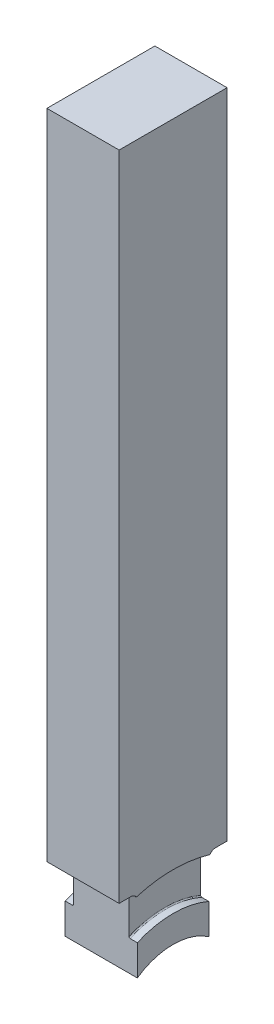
ISO-10303-21;
HEADER;
FILE_DESCRIPTION(('STEP AP214'),'2;1');
FILE_NAME('part.step','',(''),(''),'','','');
FILE_SCHEMA(('AUTOMOTIVE_DESIGN { 1 0 10303 214 1 1 1 1 }'));
ENDSEC;
DATA;
#1=APPLICATION_CONTEXT('core data for automotive mechanical design processes');
#2=APPLICATION_PROTOCOL_DEFINITION('international standard','automotive_design',2000,#1);
#3=PRODUCT_CONTEXT('',#1,'mechanical');
#4=PRODUCT('Part','Part','',(#3));
#5=PRODUCT_RELATED_PRODUCT_CATEGORY('part','',(#4));
#6=PRODUCT_DEFINITION_FORMATION('','',#4);
#7=PRODUCT_DEFINITION_CONTEXT('part definition',#1,'design');
#8=PRODUCT_DEFINITION('design','',#6,#7);
#9=PRODUCT_DEFINITION_SHAPE('','',#8);
#10=(LENGTH_UNIT() NAMED_UNIT(*) SI_UNIT(.MILLI.,.METRE.));
#11=(NAMED_UNIT(*) PLANE_ANGLE_UNIT() SI_UNIT($,.RADIAN.));
#12=(NAMED_UNIT(*) SI_UNIT($,.STERADIAN.) SOLID_ANGLE_UNIT());
#13=UNCERTAINTY_MEASURE_WITH_UNIT(LENGTH_MEASURE(1.E-05),#10,'distance_accuracy_value','');
#14=(GEOMETRIC_REPRESENTATION_CONTEXT(3) GLOBAL_UNCERTAINTY_ASSIGNED_CONTEXT((#13)) GLOBAL_UNIT_ASSIGNED_CONTEXT((#10,
#11,#12)) REPRESENTATION_CONTEXT('',''));
#15=CARTESIAN_POINT('',(0.,0.,0.));
#16=DIRECTION('',(0.,0.,1.));
#17=DIRECTION('',(1.,0.,0.));
#18=AXIS2_PLACEMENT_3D('',#15,#16,#17);
#19=CARTESIAN_POINT('',(12.827,276.225,19.177));
#20=DIRECTION('',(0.,0.,-1.));
#21=DIRECTION('',(0.,1.,0.));
#22=AXIS2_PLACEMENT_3D('',#19,#20,#21);
#23=PLANE('',#22);
#24=DIRECTION('',(0.,-1.,0.));
#25=VECTOR('',#24,1.);
#26=CARTESIAN_POINT('',(-12.827,276.225,19.177));
#27=LINE('',#26,#25);
#28=CARTESIAN_POINT('',(-12.827,276.225,19.177));
#29=VERTEX_POINT('',#28);
#30=CARTESIAN_POINT('',(-12.8270000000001,44.4246,19.177));
#31=VERTEX_POINT('',#30);
#32=EDGE_CURVE('E317',#29,#31,#27,.T.);
#33=ORIENTED_EDGE('',*,*,#32,.T.);
#34=DIRECTION('',(1.,0.,0.));
#35=VECTOR('',#34,1.);
#36=CARTESIAN_POINT('',(12.827,44.4246,19.177));
#37=LINE('',#36,#35);
#38=CARTESIAN_POINT('',(12.8270000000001,44.4246,19.177));
#39=VERTEX_POINT('',#38);
#40=EDGE_CURVE('E284',#31,#39,#37,.T.);
#41=ORIENTED_EDGE('',*,*,#40,.T.);
#42=DIRECTION('',(0.,-1.,0.));
#43=VECTOR('',#42,1.);
#44=CARTESIAN_POINT('',(12.827,276.225,19.177));
#45=LINE('',#44,#43);
#46=CARTESIAN_POINT('',(12.827,276.225,19.177));
#47=VERTEX_POINT('',#46);
#48=EDGE_CURVE('E308',#47,#39,#45,.T.);
#49=ORIENTED_EDGE('',*,*,#48,.F.);
#50=DIRECTION('',(-1.,0.,0.));
#51=VECTOR('',#50,1.);
#52=CARTESIAN_POINT('',(12.827,276.225,19.177));
#53=LINE('',#52,#51);
#54=EDGE_CURVE('E323',#47,#29,#53,.T.);
#55=ORIENTED_EDGE('',*,*,#54,.T.);
#56=EDGE_LOOP('',(#33,#41,#49,#55));
#57=FACE_BOUND('',#56,.T.);
#58=ADVANCED_FACE('F37',(#57),#23,.F.);
#59=CARTESIAN_POINT('',(12.827,276.225,-19.177));
#60=DIRECTION('',(0.,0.,1.));
#61=DIRECTION('',(0.,-1.,0.));
#62=AXIS2_PLACEMENT_3D('',#59,#60,#61);
#63=PLANE('',#62);
#64=DIRECTION('',(0.,1.,0.));
#65=VECTOR('',#64,1.);
#66=CARTESIAN_POINT('',(12.827,276.225,-19.177));
#67=LINE('',#66,#65);
#68=CARTESIAN_POINT('',(12.8270000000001,44.4246,-19.177));
#69=VERTEX_POINT('',#68);
#70=CARTESIAN_POINT('',(12.827,276.225,-19.177));
#71=VERTEX_POINT('',#70);
#72=EDGE_CURVE('E312',#69,#71,#67,.T.);
#73=ORIENTED_EDGE('',*,*,#72,.F.);
#74=DIRECTION('',(-1.,0.,0.));
#75=VECTOR('',#74,1.);
#76=CARTESIAN_POINT('',(12.827,44.4246,-19.177));
#77=LINE('',#76,#75);
#78=CARTESIAN_POINT('',(-12.8270000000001,44.4246,-19.177));
#79=VERTEX_POINT('',#78);
#80=EDGE_CURVE('E196',#69,#79,#77,.T.);
#81=ORIENTED_EDGE('',*,*,#80,.T.);
#82=DIRECTION('',(0.,1.,0.));
#83=VECTOR('',#82,1.);
#84=CARTESIAN_POINT('',(-12.827,276.225,-19.177));
#85=LINE('',#84,#83);
#86=CARTESIAN_POINT('',(-12.827,276.225,-19.177));
#87=VERTEX_POINT('',#86);
#88=EDGE_CURVE('E309',#79,#87,#85,.T.);
#89=ORIENTED_EDGE('',*,*,#88,.T.);
#90=DIRECTION('',(-1.,0.,0.));
#91=VECTOR('',#90,1.);
#92=CARTESIAN_POINT('',(12.827,276.225,-19.177));
#93=LINE('',#92,#91);
#94=EDGE_CURVE('E314',#71,#87,#93,.T.);
#95=ORIENTED_EDGE('',*,*,#94,.F.);
#96=EDGE_LOOP('',(#73,#81,#89,#95));
#97=FACE_BOUND('',#96,.T.);
#98=ADVANCED_FACE('F435',(#97),#63,.F.);
#99=CARTESIAN_POINT('',(12.827,0.,0.));
#100=DIRECTION('',(-1.,0.,0.));
#101=DIRECTION('',(0.,0.,1.));
#102=AXIS2_PLACEMENT_3D('',#99,#100,#101);
#103=PLANE('',#102);
#104=CARTESIAN_POINT('',(12.827,0.,0.));
#105=DIRECTION('',(1.,0.,0.));
#106=DIRECTION('',(0.,0.,-1.));
#107=AXIS2_PLACEMENT_3D('',#104,#105,#106);
#108=CIRCLE('',#107,22.225);
#109=CARTESIAN_POINT('',(12.8270000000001,18.2389864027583,-12.7));
#110=VERTEX_POINT('',#109);
#111=CARTESIAN_POINT('',(12.8270000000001,18.2389864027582,12.7));
#112=VERTEX_POINT('',#111);
#113=EDGE_CURVE('E294',#110,#112,#108,.T.);
#114=ORIENTED_EDGE('',*,*,#113,.F.);
#115=DIRECTION('',(0.,-1.,0.));
#116=VECTOR('',#115,1.);
#117=CARTESIAN_POINT('',(12.8270000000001,0.,-12.7));
#118=LINE('',#117,#116);
#119=CARTESIAN_POINT('',(12.8270000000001,29.0993556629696,-12.7));
#120=VERTEX_POINT('',#119);
#121=EDGE_CURVE('E201',#120,#110,#118,.T.);
#122=ORIENTED_EDGE('',*,*,#121,.F.);
#123=CARTESIAN_POINT('',(12.8270000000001,0.,0.));
#124=DIRECTION('',(-1.,0.,0.));
#125=DIRECTION('',(0.,0.,1.));
#126=AXIS2_PLACEMENT_3D('',#123,#124,#125);
#127=CIRCLE('',#126,31.75);
#128=CARTESIAN_POINT('',(12.8270000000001,29.0993556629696,12.7));
#129=VERTEX_POINT('',#128);
#130=EDGE_CURVE('E290',#129,#120,#127,.T.);
#131=ORIENTED_EDGE('',*,*,#130,.F.);
#132=DIRECTION('',(0.,1.,0.));
#133=VECTOR('',#132,1.);
#134=CARTESIAN_POINT('',(12.8270000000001,0.,12.7));
#135=LINE('',#134,#133);
#136=EDGE_CURVE('E234',#112,#129,#135,.T.);
#137=ORIENTED_EDGE('',*,*,#136,.F.);
#138=EDGE_LOOP('',(#114,#122,#131,#137));
#139=FACE_BOUND('',#138,.T.);
#140=ADVANCED_FACE('F429',(#139),#103,.F.);
#141=CARTESIAN_POINT('',(-12.827,0.,0.));
#142=DIRECTION('',(-1.,0.,0.));
#143=DIRECTION('',(0.,0.,1.));
#144=AXIS2_PLACEMENT_3D('',#141,#142,#143);
#145=PLANE('',#144);
#146=CARTESIAN_POINT('',(-12.8270000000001,42.037,-15.0876));
#147=DIRECTION('',(1.,0.,0.));
#148=DIRECTION('',(0.,0.,1.));
#149=AXIS2_PLACEMENT_3D('',#146,#147,#148);
#150=CIRCLE('',#149,2.3876);
#151=CARTESIAN_POINT('',(-12.8270000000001,44.4246,-15.0876));
#152=VERTEX_POINT('',#151);
#153=CARTESIAN_POINT('',(-12.8270000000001,43.3090510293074,-13.0670753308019));
#154=VERTEX_POINT('',#153);
#155=EDGE_CURVE('E209',#152,#154,#150,.T.);
#156=ORIENTED_EDGE('',*,*,#155,.T.);
#157=CARTESIAN_POINT('',(-12.8270000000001,0.,0.));
#158=DIRECTION('',(-1.,0.,0.));
#159=DIRECTION('',(0.,0.,1.));
#160=AXIS2_PLACEMENT_3D('',#157,#158,#159);
#161=CIRCLE('',#160,45.2374);
#162=CARTESIAN_POINT('',(-12.8270000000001,43.3090510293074,13.0670753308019));
#163=VERTEX_POINT('',#162);
#164=EDGE_CURVE('E291',#163,#154,#161,.T.);
#165=ORIENTED_EDGE('',*,*,#164,.F.);
#166=CARTESIAN_POINT('',(-12.8270000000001,42.037,15.0876));
#167=DIRECTION('',(1.,0.,0.));
#168=DIRECTION('',(0.,0.,-1.));
#169=AXIS2_PLACEMENT_3D('',#166,#167,#168);
#170=CIRCLE('',#169,2.3876);
#171=CARTESIAN_POINT('',(-12.8270000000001,44.4246,15.0876));
#172=VERTEX_POINT('',#171);
#173=EDGE_CURVE('E236',#163,#172,#170,.T.);
#174=ORIENTED_EDGE('',*,*,#173,.T.);
#175=DIRECTION('',(0.,0.,1.));
#176=VECTOR('',#175,1.);
#177=CARTESIAN_POINT('',(-12.8270000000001,44.4246,15.0876));
#178=LINE('',#177,#176);
#179=EDGE_CURVE('E239',#172,#31,#178,.T.);
#180=ORIENTED_EDGE('',*,*,#179,.T.);
#181=ORIENTED_EDGE('',*,*,#32,.F.);
#182=DIRECTION('',(0.,0.,1.));
#183=VECTOR('',#182,1.);
#184=CARTESIAN_POINT('',(-12.827,276.225,19.177));
#185=LINE('',#184,#183);
#186=EDGE_CURVE('E304',#87,#29,#185,.T.);
#187=ORIENTED_EDGE('',*,*,#186,.F.);
#188=ORIENTED_EDGE('',*,*,#88,.F.);
#189=DIRECTION('',(0.,0.,1.));
#190=VECTOR('',#189,1.);
#191=CARTESIAN_POINT('',(-12.8270000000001,44.4246,-15.0876));
#192=LINE('',#191,#190);
#193=EDGE_CURVE('E221',#79,#152,#192,.T.);
#194=ORIENTED_EDGE('',*,*,#193,.T.);
#195=EDGE_LOOP('',(#156,#165,#174,#180,#181,#187,#188,#194));
#196=FACE_BOUND('',#195,.T.);
#197=ADVANCED_FACE('F430',(#196),#145,.T.);
#198=DIRECTION('',(0.,-1.,0.));
#199=VECTOR('',#198,1.);
#200=CARTESIAN_POINT('',(-12.8270000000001,0.,-12.7));
#201=LINE('',#200,#199);
#202=CARTESIAN_POINT('',(-12.8270000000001,29.0993556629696,-12.7));
#203=VERTEX_POINT('',#202);
#204=CARTESIAN_POINT('',(-12.8270000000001,18.2389864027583,-12.7));
#205=VERTEX_POINT('',#204);
#206=EDGE_CURVE('E218',#203,#205,#201,.T.);
#207=ORIENTED_EDGE('',*,*,#206,.T.);
#208=CARTESIAN_POINT('',(-12.827,0.,0.));
#209=DIRECTION('',(1.,0.,0.));
#210=DIRECTION('',(0.,0.,-1.));
#211=AXIS2_PLACEMENT_3D('',#208,#209,#210);
#212=CIRCLE('',#211,22.225);
#213=CARTESIAN_POINT('',(-12.8270000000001,18.2389864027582,12.7));
#214=VERTEX_POINT('',#213);
#215=EDGE_CURVE('E301',#205,#214,#212,.T.);
#216=ORIENTED_EDGE('',*,*,#215,.T.);
#217=DIRECTION('',(0.,1.,0.));
#218=VECTOR('',#217,1.);
#219=CARTESIAN_POINT('',(-12.8270000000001,0.,12.7));
#220=LINE('',#219,#218);
#221=CARTESIAN_POINT('',(-12.8270000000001,29.0993556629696,12.7));
#222=VERTEX_POINT('',#221);
#223=EDGE_CURVE('E242',#214,#222,#220,.T.);
#224=ORIENTED_EDGE('',*,*,#223,.T.);
#225=CARTESIAN_POINT('',(-12.8270000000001,0.,0.));
#226=DIRECTION('',(-1.,0.,0.));
#227=DIRECTION('',(0.,0.,1.));
#228=AXIS2_PLACEMENT_3D('',#225,#226,#227);
#229=CIRCLE('',#228,31.75);
#230=EDGE_CURVE('E288',#222,#203,#229,.T.);
#231=ORIENTED_EDGE('',*,*,#230,.T.);
#232=EDGE_LOOP('',(#207,#216,#224,#231));
#233=FACE_BOUND('',#232,.T.);
#234=ADVANCED_FACE('F433',(#233),#145,.T.);
#235=CARTESIAN_POINT('',(12.827,276.225,19.177));
#236=DIRECTION('',(0.,-1.,0.));
#237=DIRECTION('',(0.,0.,-1.));
#238=AXIS2_PLACEMENT_3D('',#235,#236,#237);
#239=PLANE('',#238);
#240=ORIENTED_EDGE('',*,*,#186,.T.);
#241=ORIENTED_EDGE('',*,*,#54,.F.);
#242=DIRECTION('',(0.,0.,1.));
#243=VECTOR('',#242,1.);
#244=CARTESIAN_POINT('',(12.827,276.225,19.177));
#245=LINE('',#244,#243);
#246=EDGE_CURVE('E305',#71,#47,#245,.T.);
#247=ORIENTED_EDGE('',*,*,#246,.F.);
#248=ORIENTED_EDGE('',*,*,#94,.T.);
#249=EDGE_LOOP('',(#240,#241,#247,#248));
#250=FACE_BOUND('',#249,.T.);
#251=ADVANCED_FACE('F368',(#250),#239,.F.);
#252=CARTESIAN_POINT('',(12.8270000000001,0.,0.));
#253=DIRECTION('',(-1.,0.,0.));
#254=DIRECTION('',(0.,0.,1.));
#255=AXIS2_PLACEMENT_3D('',#252,#253,#254);
#256=CIRCLE('',#255,45.2374);
#257=CARTESIAN_POINT('',(12.8270000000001,43.3090510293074,13.0670753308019));
#258=VERTEX_POINT('',#257);
#259=CARTESIAN_POINT('',(12.8270000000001,43.3090510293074,-13.0670753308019));
#260=VERTEX_POINT('',#259);
#261=EDGE_CURVE('E217',#258,#260,#256,.T.);
#262=ORIENTED_EDGE('',*,*,#261,.T.);
#263=CARTESIAN_POINT('',(12.8270000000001,42.037,-15.0876));
#264=DIRECTION('',(1.,0.,0.));
#265=DIRECTION('',(0.,0.,1.));
#266=AXIS2_PLACEMENT_3D('',#263,#264,#265);
#267=CIRCLE('',#266,2.3876);
#268=CARTESIAN_POINT('',(12.8270000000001,44.4246,-15.0876));
#269=VERTEX_POINT('',#268);
#270=EDGE_CURVE('E200',#269,#260,#267,.T.);
#271=ORIENTED_EDGE('',*,*,#270,.F.);
#272=DIRECTION('',(0.,0.,1.));
#273=VECTOR('',#272,1.);
#274=CARTESIAN_POINT('',(12.8270000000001,44.4246,-15.0876));
#275=LINE('',#274,#273);
#276=EDGE_CURVE('E190',#69,#269,#275,.T.);
#277=ORIENTED_EDGE('',*,*,#276,.F.);
#278=ORIENTED_EDGE('',*,*,#72,.T.);
#279=ORIENTED_EDGE('',*,*,#246,.T.);
#280=ORIENTED_EDGE('',*,*,#48,.T.);
#281=DIRECTION('',(0.,0.,1.));
#282=VECTOR('',#281,1.);
#283=CARTESIAN_POINT('',(12.8270000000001,44.4246,15.0876));
#284=LINE('',#283,#282);
#285=CARTESIAN_POINT('',(12.8270000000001,44.4246,15.0876));
#286=VERTEX_POINT('',#285);
#287=EDGE_CURVE('E232',#286,#39,#284,.T.);
#288=ORIENTED_EDGE('',*,*,#287,.F.);
#289=CARTESIAN_POINT('',(12.8270000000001,42.037,15.0876));
#290=DIRECTION('',(1.,0.,0.));
#291=DIRECTION('',(0.,0.,-1.));
#292=AXIS2_PLACEMENT_3D('',#289,#290,#291);
#293=CIRCLE('',#292,2.3876);
#294=EDGE_CURVE('E230',#258,#286,#293,.T.);
#295=ORIENTED_EDGE('',*,*,#294,.F.);
#296=EDGE_LOOP('',(#262,#271,#277,#278,#279,#280,#288,#295));
#297=FACE_BOUND('',#296,.T.);
#298=ADVANCED_FACE('F214',(#297),#103,.F.);
#299=CARTESIAN_POINT('',(-12.827,0.,0.));
#300=DIRECTION('',(1.,0.,0.));
#301=DIRECTION('',(0.,0.,-1.));
#302=AXIS2_PLACEMENT_3D('',#299,#300,#301);
#303=CYLINDRICAL_SURFACE('',#302,22.225);
#304=ORIENTED_EDGE('',*,*,#215,.F.);
#305=DIRECTION('',(1.,0.,0.));
#306=VECTOR('',#305,1.);
#307=CARTESIAN_POINT('',(-12.827,18.2389864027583,-12.7));
#308=LINE('',#307,#306);
#309=EDGE_CURVE('E281',#205,#110,#308,.T.);
#310=ORIENTED_EDGE('',*,*,#309,.T.);
#311=ORIENTED_EDGE('',*,*,#113,.T.);
#312=DIRECTION('',(1.,0.,0.));
#313=VECTOR('',#312,1.);
#314=CARTESIAN_POINT('',(-12.827,18.2389864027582,12.7));
#315=LINE('',#314,#313);
#316=EDGE_CURVE('E271',#112,#214,#315,.F.);
#317=ORIENTED_EDGE('',*,*,#316,.T.);
#318=EDGE_LOOP('',(#304,#310,#311,#317));
#319=FACE_BOUND('',#318,.T.);
#320=ADVANCED_FACE('F416',(#319),#303,.F.);
#321=CARTESIAN_POINT('',(-9.85520000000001,31.75,0.));
#322=DIRECTION('',(-1.,0.,0.));
#323=DIRECTION('',(0.,0.,1.));
#324=AXIS2_PLACEMENT_3D('',#321,#322,#323);
#325=PLANE('',#324);
#326=DIRECTION('',(0.,1.,0.));
#327=VECTOR('',#326,1.);
#328=CARTESIAN_POINT('',(-9.85520000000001,31.75,-12.7));
#329=LINE('',#328,#327);
#330=CARTESIAN_POINT('',(-9.85520000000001,29.5145923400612,-12.7));
#331=VERTEX_POINT('',#330);
#332=CARTESIAN_POINT('',(-9.85520000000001,42.037,-12.7));
#333=VERTEX_POINT('',#332);
#334=EDGE_CURVE('E279',#331,#333,#329,.T.);
#335=ORIENTED_EDGE('',*,*,#334,.F.);
#336=CARTESIAN_POINT('',(-9.85520000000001,0.,0.));
#337=DIRECTION('',(-1.,0.,0.));
#338=DIRECTION('',(0.,0.,1.));
#339=AXIS2_PLACEMENT_3D('',#336,#337,#338);
#340=CIRCLE('',#339,32.131);
#341=CARTESIAN_POINT('',(-9.85520000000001,29.5145923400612,12.7));
#342=VERTEX_POINT('',#341);
#343=EDGE_CURVE('E474',#331,#342,#340,.F.);
#344=ORIENTED_EDGE('',*,*,#343,.T.);
#345=DIRECTION('',(0.,-1.,0.));
#346=VECTOR('',#345,1.);
#347=CARTESIAN_POINT('',(-9.85520000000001,31.75,12.7));
#348=LINE('',#347,#346);
#349=CARTESIAN_POINT('',(-9.85520000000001,42.037,12.7));
#350=VERTEX_POINT('',#349);
#351=EDGE_CURVE('E268',#350,#342,#348,.T.);
#352=ORIENTED_EDGE('',*,*,#351,.F.);
#353=CARTESIAN_POINT('',(-9.85520000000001,42.037,15.0876));
#354=DIRECTION('',(-1.,0.,0.));
#355=DIRECTION('',(0.,0.,1.));
#356=AXIS2_PLACEMENT_3D('',#353,#354,#355);
#357=CIRCLE('',#356,2.3876);
#358=CARTESIAN_POINT('',(-9.85520000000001,42.6032439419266,12.7681169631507));
#359=VERTEX_POINT('',#358);
#360=EDGE_CURVE('E256',#359,#350,#357,.T.);
#361=ORIENTED_EDGE('',*,*,#360,.F.);
#362=CARTESIAN_POINT('',(-9.85520000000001,0.,0.));
#363=DIRECTION('',(-1.,0.,0.));
#364=DIRECTION('',(0.,0.,1.));
#365=AXIS2_PLACEMENT_3D('',#362,#363,#364);
#366=CIRCLE('',#365,44.4754);
#367=CARTESIAN_POINT('',(-9.85520000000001,42.6032439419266,-12.7681169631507));
#368=VERTEX_POINT('',#367);
#369=EDGE_CURVE('E334',#359,#368,#366,.T.);
#370=ORIENTED_EDGE('',*,*,#369,.T.);
#371=CARTESIAN_POINT('',(-9.85520000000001,42.037,-15.0876));
#372=DIRECTION('',(-1.,0.,0.));
#373=DIRECTION('',(0.,0.,1.));
#374=AXIS2_PLACEMENT_3D('',#371,#372,#373);
#375=CIRCLE('',#374,2.3876);
#376=EDGE_CURVE('E262',#333,#368,#375,.T.);
#377=ORIENTED_EDGE('',*,*,#376,.F.);
#378=EDGE_LOOP('',(#335,#344,#352,#361,#370,#377));
#379=FACE_BOUND('',#378,.T.);
#380=ADVANCED_FACE('F412',(#379),#325,.T.);
#381=CARTESIAN_POINT('',(-8.84822894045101,0.,0.));
#382=DIRECTION('',(-1.,0.,0.));
#383=DIRECTION('',(0.,0.,1.));
#384=AXIS2_PLACEMENT_3D('',#381,#382,#383);
#385=CYLINDRICAL_SURFACE('',#384,45.2374);
#386=DIRECTION('',(1.,0.,0.));
#387=VECTOR('',#386,1.);
#388=CARTESIAN_POINT('',(-11.3411,43.3090510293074,-13.0670753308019));
#389=LINE('',#388,#387);
#390=CARTESIAN_POINT('',(-10.6172,43.3090510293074,-13.0670753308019));
#391=VERTEX_POINT('',#390);
#392=EDGE_CURVE('E260',#391,#154,#389,.F.);
#393=ORIENTED_EDGE('',*,*,#392,.F.);
#394=CARTESIAN_POINT('',(-10.6172,0.,0.));
#395=DIRECTION('',(-1.,0.,0.));
#396=DIRECTION('',(0.,0.,1.));
#397=AXIS2_PLACEMENT_3D('',#394,#395,#396);
#398=CIRCLE('',#397,45.2374);
#399=CARTESIAN_POINT('',(-10.6172,43.3090510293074,13.0670753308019));
#400=VERTEX_POINT('',#399);
#401=EDGE_CURVE('E337',#391,#400,#398,.F.);
#402=ORIENTED_EDGE('',*,*,#401,.T.);
#403=DIRECTION('',(1.,0.,0.));
#404=VECTOR('',#403,1.);
#405=CARTESIAN_POINT('',(-11.3411,43.3090510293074,13.0670753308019));
#406=LINE('',#405,#404);
#407=EDGE_CURVE('E253',#163,#400,#406,.T.);
#408=ORIENTED_EDGE('',*,*,#407,.F.);
#409=ORIENTED_EDGE('',*,*,#164,.T.);
#410=EDGE_LOOP('',(#393,#402,#408,#409));
#411=FACE_BOUND('',#410,.T.);
#412=ADVANCED_FACE('F415',(#411),#385,.F.);
#413=CARTESIAN_POINT('',(-8.84822894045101,0.,0.));
#414=DIRECTION('',(-1.,0.,0.));
#415=DIRECTION('',(0.,0.,1.));
#416=AXIS2_PLACEMENT_3D('',#413,#414,#415);
#417=CYLINDRICAL_SURFACE('',#416,31.75);
#418=DIRECTION('',(-1.,0.,0.));
#419=VECTOR('',#418,1.);
#420=CARTESIAN_POINT('',(-8.84822894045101,29.0993556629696,12.7));
#421=LINE('',#420,#419);
#422=CARTESIAN_POINT('',(-10.2362,29.0993556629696,12.7));
#423=VERTEX_POINT('',#422);
#424=EDGE_CURVE('E266',#423,#222,#421,.T.);
#425=ORIENTED_EDGE('',*,*,#424,.F.);
#426=CARTESIAN_POINT('',(-10.2362,0.,0.));
#427=DIRECTION('',(-1.,0.,0.));
#428=DIRECTION('',(0.,0.,1.));
#429=AXIS2_PLACEMENT_3D('',#426,#427,#428);
#430=CIRCLE('',#429,31.75);
#431=CARTESIAN_POINT('',(-10.2362,29.0993556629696,-12.7));
#432=VERTEX_POINT('',#431);
#433=EDGE_CURVE('E389',#423,#432,#430,.T.);
#434=ORIENTED_EDGE('',*,*,#433,.T.);
#435=DIRECTION('',(-1.,0.,0.));
#436=VECTOR('',#435,1.);
#437=CARTESIAN_POINT('',(-8.84822894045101,29.0993556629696,-12.7));
#438=LINE('',#437,#436);
#439=EDGE_CURVE('E276',#203,#432,#438,.F.);
#440=ORIENTED_EDGE('',*,*,#439,.F.);
#441=ORIENTED_EDGE('',*,*,#230,.F.);
#442=EDGE_LOOP('',(#425,#434,#440,#441));
#443=FACE_BOUND('',#442,.T.);
#444=ADVANCED_FACE('F408',(#443),#417,.T.);
#445=CARTESIAN_POINT('',(9.8552,31.75,0.));
#446=DIRECTION('',(1.,0.,0.));
#447=DIRECTION('',(0.,0.,-1.));
#448=AXIS2_PLACEMENT_3D('',#445,#446,#447);
#449=PLANE('',#448);
#450=DIRECTION('',(0.,1.,0.));
#451=VECTOR('',#450,1.);
#452=CARTESIAN_POINT('',(9.8552,31.75,12.7));
#453=LINE('',#452,#451);
#454=CARTESIAN_POINT('',(9.8552,29.5145923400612,12.7));
#455=VERTEX_POINT('',#454);
#456=CARTESIAN_POINT('',(9.8552,42.037,12.7));
#457=VERTEX_POINT('',#456);
#458=EDGE_CURVE('E264',#455,#457,#453,.T.);
#459=ORIENTED_EDGE('',*,*,#458,.F.);
#460=CARTESIAN_POINT('',(9.8552,0.,0.));
#461=DIRECTION('',(1.,0.,0.));
#462=DIRECTION('',(0.,0.,-1.));
#463=AXIS2_PLACEMENT_3D('',#460,#461,#462);
#464=CIRCLE('',#463,32.131);
#465=CARTESIAN_POINT('',(9.8552,29.5145923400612,-12.7));
#466=VERTEX_POINT('',#465);
#467=EDGE_CURVE('E470',#455,#466,#464,.F.);
#468=ORIENTED_EDGE('',*,*,#467,.T.);
#469=DIRECTION('',(0.,-1.,0.));
#470=VECTOR('',#469,1.);
#471=CARTESIAN_POINT('',(9.8552,31.75,-12.7));
#472=LINE('',#471,#470);
#473=CARTESIAN_POINT('',(9.8552,42.037,-12.7));
#474=VERTEX_POINT('',#473);
#475=EDGE_CURVE('E274',#474,#466,#472,.T.);
#476=ORIENTED_EDGE('',*,*,#475,.F.);
#477=CARTESIAN_POINT('',(9.8552,42.037,-15.0876));
#478=DIRECTION('',(1.,0.,0.));
#479=DIRECTION('',(0.,0.,-1.));
#480=AXIS2_PLACEMENT_3D('',#477,#478,#479);
#481=CIRCLE('',#480,2.3876);
#482=CARTESIAN_POINT('',(9.8552,42.6032439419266,-12.7681169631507));
#483=VERTEX_POINT('',#482);
#484=EDGE_CURVE('E258',#483,#474,#481,.T.);
#485=ORIENTED_EDGE('',*,*,#484,.F.);
#486=CARTESIAN_POINT('',(9.8552,0.,0.));
#487=DIRECTION('',(1.,0.,0.));
#488=DIRECTION('',(0.,0.,-1.));
#489=AXIS2_PLACEMENT_3D('',#486,#487,#488);
#490=CIRCLE('',#489,44.4754);
#491=CARTESIAN_POINT('',(9.8552,42.6032439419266,12.7681169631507));
#492=VERTEX_POINT('',#491);
#493=EDGE_CURVE('E342',#483,#492,#490,.T.);
#494=ORIENTED_EDGE('',*,*,#493,.T.);
#495=CARTESIAN_POINT('',(9.8552,42.037,15.0876));
#496=DIRECTION('',(1.,0.,0.));
#497=DIRECTION('',(0.,0.,-1.));
#498=AXIS2_PLACEMENT_3D('',#495,#496,#497);
#499=CIRCLE('',#498,2.3876);
#500=EDGE_CURVE('E228',#457,#492,#499,.T.);
#501=ORIENTED_EDGE('',*,*,#500,.F.);
#502=EDGE_LOOP('',(#459,#468,#476,#485,#494,#501));
#503=FACE_BOUND('',#502,.T.);
#504=ADVANCED_FACE('F405',(#503),#449,.T.);
#505=CARTESIAN_POINT('',(-8.84822894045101,0.,0.));
#506=DIRECTION('',(-1.,0.,0.));
#507=DIRECTION('',(0.,0.,1.));
#508=AXIS2_PLACEMENT_3D('',#505,#506,#507);
#509=CYLINDRICAL_SURFACE('',#508,31.75);
#510=DIRECTION('',(-1.,0.,0.));
#511=VECTOR('',#510,1.);
#512=CARTESIAN_POINT('',(-8.84822894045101,29.0993556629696,-12.7));
#513=LINE('',#512,#511);
#514=CARTESIAN_POINT('',(10.2362,29.0993556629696,-12.7));
#515=VERTEX_POINT('',#514);
#516=EDGE_CURVE('E332',#515,#120,#513,.F.);
#517=ORIENTED_EDGE('',*,*,#516,.F.);
#518=CARTESIAN_POINT('',(10.2362,0.,0.));
#519=DIRECTION('',(1.,0.,0.));
#520=DIRECTION('',(0.,0.,-1.));
#521=AXIS2_PLACEMENT_3D('',#518,#519,#520);
#522=CIRCLE('',#521,31.75);
#523=CARTESIAN_POINT('',(10.2362,29.0993556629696,12.7));
#524=VERTEX_POINT('',#523);
#525=EDGE_CURVE('E58',#515,#524,#522,.T.);
#526=ORIENTED_EDGE('',*,*,#525,.T.);
#527=DIRECTION('',(-1.,0.,0.));
#528=VECTOR('',#527,1.);
#529=CARTESIAN_POINT('',(-8.84822894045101,29.0993556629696,12.7));
#530=LINE('',#529,#528);
#531=EDGE_CURVE('E330',#129,#524,#530,.T.);
#532=ORIENTED_EDGE('',*,*,#531,.F.);
#533=ORIENTED_EDGE('',*,*,#130,.T.);
#534=EDGE_LOOP('',(#517,#526,#532,#533));
#535=FACE_BOUND('',#534,.T.);
#536=ADVANCED_FACE('F403',(#535),#509,.T.);
#537=CARTESIAN_POINT('',(-8.84822894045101,0.,0.));
#538=DIRECTION('',(-1.,0.,0.));
#539=DIRECTION('',(0.,0.,1.));
#540=AXIS2_PLACEMENT_3D('',#537,#538,#539);
#541=CYLINDRICAL_SURFACE('',#540,45.2374);
#542=DIRECTION('',(1.,0.,0.));
#543=VECTOR('',#542,1.);
#544=CARTESIAN_POINT('',(0.,43.3090510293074,13.0670753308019));
#545=LINE('',#544,#543);
#546=CARTESIAN_POINT('',(10.6172,43.3090510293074,13.0670753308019));
#547=VERTEX_POINT('',#546);
#548=EDGE_CURVE('E326',#547,#258,#545,.T.);
#549=ORIENTED_EDGE('',*,*,#548,.F.);
#550=CARTESIAN_POINT('',(10.6172,0.,0.));
#551=DIRECTION('',(1.,0.,0.));
#552=DIRECTION('',(0.,0.,-1.));
#553=AXIS2_PLACEMENT_3D('',#550,#551,#552);
#554=CIRCLE('',#553,45.2374);
#555=CARTESIAN_POINT('',(10.6172,43.3090510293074,-13.0670753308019));
#556=VERTEX_POINT('',#555);
#557=EDGE_CURVE('E339',#547,#556,#554,.F.);
#558=ORIENTED_EDGE('',*,*,#557,.T.);
#559=DIRECTION('',(1.,0.,0.));
#560=VECTOR('',#559,1.);
#561=CARTESIAN_POINT('',(0.,43.3090510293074,-13.0670753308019));
#562=LINE('',#561,#560);
#563=EDGE_CURVE('E328',#260,#556,#562,.F.);
#564=ORIENTED_EDGE('',*,*,#563,.F.);
#565=ORIENTED_EDGE('',*,*,#261,.F.);
#566=EDGE_LOOP('',(#549,#558,#564,#565));
#567=FACE_BOUND('',#566,.T.);
#568=ADVANCED_FACE('F399',(#567),#541,.F.);
#569=CARTESIAN_POINT('',(-12.8270000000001,44.4246,15.0876));
#570=DIRECTION('',(0.,1.,0.));
#571=DIRECTION('',(0.,0.,1.));
#572=AXIS2_PLACEMENT_3D('',#569,#570,#571);
#573=PLANE('',#572);
#574=ORIENTED_EDGE('',*,*,#179,.F.);
#575=DIRECTION('',(1.,0.,0.));
#576=VECTOR('',#575,1.);
#577=CARTESIAN_POINT('',(-12.8270000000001,44.4246,15.0876));
#578=LINE('',#577,#576);
#579=EDGE_CURVE('E245',#172,#286,#578,.T.);
#580=ORIENTED_EDGE('',*,*,#579,.T.);
#581=ORIENTED_EDGE('',*,*,#287,.T.);
#582=ORIENTED_EDGE('',*,*,#40,.F.);
#583=EDGE_LOOP('',(#574,#580,#581,#582));
#584=FACE_BOUND('',#583,.T.);
#585=ADVANCED_FACE('F398',(#584),#573,.F.);
#586=CARTESIAN_POINT('',(-12.8270000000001,0.,12.7));
#587=DIRECTION('',(0.,0.,-1.));
#588=DIRECTION('',(0.,1.,0.));
#589=AXIS2_PLACEMENT_3D('',#586,#587,#588);
#590=PLANE('',#589);
#591=ORIENTED_EDGE('',*,*,#136,.T.);
#592=ORIENTED_EDGE('',*,*,#531,.T.);
#593=CARTESIAN_POINT('',(10.2362,29.0993556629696,12.7));
#594=CARTESIAN_POINT('',(10.2160442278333,29.0993303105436,12.7));
#595=CARTESIAN_POINT('',(10.1959043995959,29.1010990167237,12.7));
#596=CARTESIAN_POINT('',(10.1562770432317,29.1080244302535,12.7));
#597=CARTESIAN_POINT('',(10.1367877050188,29.1131707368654,12.7));
#598=CARTESIAN_POINT('',(10.0989580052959,29.1266510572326,12.7));
#599=CARTESIAN_POINT('',(10.0806172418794,29.1349839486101,12.7));
#600=CARTESIAN_POINT('',(10.0455248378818,29.154510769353,12.7));
#601=CARTESIAN_POINT('',(10.0287739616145,29.1657060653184,12.7));
#602=CARTESIAN_POINT('',(9.99668843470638,29.1910002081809,12.7));
#603=CARTESIAN_POINT('',(9.98142212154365,29.2051855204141,12.7));
#604=CARTESIAN_POINT('',(9.95327515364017,29.2357483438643,12.7));
#605=CARTESIAN_POINT('',(9.94039510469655,29.2521264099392,12.7));
#606=CARTESIAN_POINT('',(9.91630689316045,29.2879834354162,12.7));
#607=CARTESIAN_POINT('',(9.90531143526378,29.3076051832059,12.7));
#608=CARTESIAN_POINT('',(9.88649650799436,29.3483221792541,12.7));
#609=CARTESIAN_POINT('',(9.87867867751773,29.3694181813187,12.7));
#610=CARTESIAN_POINT('',(9.86674874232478,29.4110601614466,12.7));
#611=CARTESIAN_POINT('',(9.86241896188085,29.4315443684,12.7));
#612=CARTESIAN_POINT('',(9.85664464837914,29.472883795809,12.7));
#613=CARTESIAN_POINT('',(9.85519568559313,29.4937383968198,12.7));
#614=CARTESIAN_POINT('',(9.8552,29.5145923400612,12.7));
#615=B_SPLINE_CURVE_WITH_KNOTS('',3,(#593,#594,#595,#596,#597,#598,#599,#600,#601,#602,#603,
#604,#605,#606,#607,#608,#609,#610,#611,#612,#613,#614),.UNSPECIFIED.,.F.,.F.,(4,2,2,2,2,2,2,2,
2,2,4),(0.,0.0603650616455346,0.120545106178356,0.180703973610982,0.240891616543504,
0.303144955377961,0.365414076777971,0.432606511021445,0.499833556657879,0.562442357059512,
0.624954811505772),.UNSPECIFIED.);
#616=EDGE_CURVE('E11',#524,#455,#615,.T.);
#617=ORIENTED_EDGE('',*,*,#616,.T.);
#618=ORIENTED_EDGE('',*,*,#458,.T.);
#619=DIRECTION('',(1.,0.,0.));
#620=VECTOR('',#619,1.);
#621=CARTESIAN_POINT('',(-12.8270000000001,42.037,12.7));
#622=LINE('',#621,#620);
#623=EDGE_CURVE('E246',#350,#457,#622,.T.);
#624=ORIENTED_EDGE('',*,*,#623,.F.);
#625=ORIENTED_EDGE('',*,*,#351,.T.);
#626=CARTESIAN_POINT('',(-9.85520000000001,29.5145923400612,12.7));
#627=CARTESIAN_POINT('',(-9.85518967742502,29.4896301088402,12.7));
#628=CARTESIAN_POINT('',(-9.85726978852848,29.4646614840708,12.7));
#629=CARTESIAN_POINT('',(-9.86554425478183,29.4153652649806,12.7));
#630=CARTESIAN_POINT('',(-9.87174683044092,29.3910390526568,12.7));
#631=CARTESIAN_POINT('',(-9.88821000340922,29.3437555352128,12.7));
#632=CARTESIAN_POINT('',(-9.89847598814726,29.3208000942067,12.7));
#633=CARTESIAN_POINT('',(-9.92288445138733,29.2770659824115,12.7));
#634=CARTESIAN_POINT('',(-9.93702329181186,29.2562852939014,12.7));
#635=CARTESIAN_POINT('',(-9.96816546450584,29.2185435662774,12.7));
#636=CARTESIAN_POINT('',(-9.9850106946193,29.201452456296,12.7));
#637=CARTESIAN_POINT('',(-10.0215723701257,29.1706560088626,12.7));
#638=CARTESIAN_POINT('',(-10.0412883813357,29.1569501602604,12.7));
#639=CARTESIAN_POINT('',(-10.0812215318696,29.1345759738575,12.7));
#640=CARTESIAN_POINT('',(-10.1012553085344,29.1255796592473,12.7));
#641=CARTESIAN_POINT('',(-10.1426125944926,29.1114017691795,12.7));
#642=CARTESIAN_POINT('',(-10.1639335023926,29.106212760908,12.7));
#643=CARTESIAN_POINT('',(-10.1939164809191,29.1018194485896,12.7));
#644=CARTESIAN_POINT('',(-10.2023531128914,29.100895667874,12.7));
#645=CARTESIAN_POINT('',(-10.2192583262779,29.0996644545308,12.7));
#646=CARTESIAN_POINT('',(-10.2277268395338,29.0993560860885,12.7));
#647=CARTESIAN_POINT('',(-10.2362,29.0993556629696,12.7));
#648=B_SPLINE_CURVE_WITH_KNOTS('',3,(#626,#627,#628,#629,#630,#631,#632,#633,#634,#635,#636,
#637,#638,#639,#640,#641,#642,#643,#644,#645,#646,#647),.UNSPECIFIED.,.F.,.F.,(4,2,2,2,2,2,2,2,
2,2,4),(0.,0.0748119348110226,0.14977349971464,0.224834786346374,0.29982580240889,
0.371431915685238,0.443027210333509,0.508568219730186,0.573980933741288,0.599424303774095,
0.624828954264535),.UNSPECIFIED.);
#649=EDGE_CURVE('E485',#342,#423,#648,.T.);
#650=ORIENTED_EDGE('',*,*,#649,.T.);
#651=ORIENTED_EDGE('',*,*,#424,.T.);
#652=ORIENTED_EDGE('',*,*,#223,.F.);
#653=ORIENTED_EDGE('',*,*,#316,.F.);
#654=EDGE_LOOP('',(#591,#592,#617,#618,#624,#625,#650,#651,#652,#653));
#655=FACE_BOUND('',#654,.T.);
#656=ADVANCED_FACE('F396',(#655),#590,.F.);
#657=CARTESIAN_POINT('',(-12.8270000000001,42.037,15.0876));
#658=DIRECTION('',(1.,0.,0.));
#659=DIRECTION('',(0.,0.,-1.));
#660=AXIS2_PLACEMENT_3D('',#657,#658,#659);
#661=CYLINDRICAL_SURFACE('',#660,2.3876);
#662=ORIENTED_EDGE('',*,*,#407,.T.);
#663=CARTESIAN_POINT('',(-10.6172,43.3090510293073,13.0670753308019));
#664=CARTESIAN_POINT('',(-10.5750852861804,43.3090762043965,13.067128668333));
#665=CARTESIAN_POINT('',(-10.5330005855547,43.3059886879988,13.0651476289));
#666=CARTESIAN_POINT('',(-10.4501486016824,43.2937934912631,13.0575273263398));
#667=CARTESIAN_POINT('',(-10.4093784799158,43.284699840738,13.0518965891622));
#668=CARTESIAN_POINT('',(-10.330213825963,43.2606982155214,13.0373853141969));
#669=CARTESIAN_POINT('',(-10.2918188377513,43.2457913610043,13.0285054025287));
#670=CARTESIAN_POINT('',(-10.2183687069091,43.2104834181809,13.0081801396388));
#671=CARTESIAN_POINT('',(-10.183314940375,43.1900800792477,12.9967337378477));
#672=CARTESIAN_POINT('',(-10.1166760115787,43.1436452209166,12.971783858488));
#673=CARTESIAN_POINT('',(-10.0851881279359,43.1174960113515,12.9582394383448));
#674=CARTESIAN_POINT('',(-10.0274480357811,43.0603611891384,12.9301995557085));
#675=CARTESIAN_POINT('',(-10.0011964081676,43.0293750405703,12.915703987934));
#676=CARTESIAN_POINT('',(-9.95444566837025,42.9628880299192,12.8865334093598));
#677=CARTESIAN_POINT('',(-9.93400466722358,42.9273463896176,12.8718580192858));
#678=CARTESIAN_POINT('',(-9.89988117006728,42.852853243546,12.8433623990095));
#679=CARTESIAN_POINT('',(-9.88619307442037,42.8139045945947,12.8295414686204));
#680=CARTESIAN_POINT('',(-9.86916777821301,42.7462019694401,12.8075759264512));
#681=CARTESIAN_POINT('',(-9.86393487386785,42.7180484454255,12.7990035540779));
#682=CARTESIAN_POINT('',(-9.85694771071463,42.6610617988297,12.7828074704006));
#683=CARTESIAN_POINT('',(-9.85519166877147,42.632229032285,12.7751832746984));
#684=CARTESIAN_POINT('',(-9.85520000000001,42.6032439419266,12.7681169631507));
#685=B_SPLINE_CURVE_WITH_KNOTS('',3,(#663,#664,#665,#666,#667,#668,#669,#670,#671,#672,#673,
#674,#675,#676,#677,#678,#679,#680,#681,#682,#683,#684),.UNSPECIFIED.,.F.,.F.,(4,2,2,2,2,2,2,2,
2,2,4),(0.,0.126138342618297,0.251983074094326,0.377803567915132,0.503675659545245,
0.632416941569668,0.761172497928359,0.891173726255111,1.02106697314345,1.11052787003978,
1.19994287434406),.UNSPECIFIED.);
#686=EDGE_CURVE('E352',#400,#359,#685,.T.);
#687=ORIENTED_EDGE('',*,*,#686,.T.);
#688=ORIENTED_EDGE('',*,*,#360,.T.);
#689=ORIENTED_EDGE('',*,*,#623,.T.);
#690=ORIENTED_EDGE('',*,*,#500,.T.);
#691=CARTESIAN_POINT('',(9.8552,42.6032439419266,12.7681169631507));
#692=CARTESIAN_POINT('',(9.85515687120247,42.6435021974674,12.7779044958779));
#693=CARTESIAN_POINT('',(9.85856700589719,42.6834639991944,12.7888093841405));
#694=CARTESIAN_POINT('',(9.87201485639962,42.7616509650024,12.8122700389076));
#695=CARTESIAN_POINT('',(9.88203664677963,42.7998800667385,12.824821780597));
#696=CARTESIAN_POINT('',(9.90843148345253,42.8736619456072,12.8510448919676));
#697=CARTESIAN_POINT('',(9.92480466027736,42.9092146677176,12.8647162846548));
#698=CARTESIAN_POINT('',(9.96339947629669,42.9768274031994,12.8924481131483));
#699=CARTESIAN_POINT('',(9.98562308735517,43.0088862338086,12.9065086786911));
#700=CARTESIAN_POINT('',(10.0358506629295,43.0694967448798,12.9345265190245));
#701=CARTESIAN_POINT('',(10.0639697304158,43.0979570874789,12.9484749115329));
#702=CARTESIAN_POINT('',(10.1249490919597,43.1499962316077,12.975082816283));
#703=CARTESIAN_POINT('',(10.1578107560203,43.1735736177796,12.9877419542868));
#704=CARTESIAN_POINT('',(10.228462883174,43.216002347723,13.0112583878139));
#705=CARTESIAN_POINT('',(10.2663685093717,43.2346970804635,13.0220528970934));
#706=CARTESIAN_POINT('',(10.3452970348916,43.2660277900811,13.040539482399));
#707=CARTESIAN_POINT('',(10.3863175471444,43.278668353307,13.0482339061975));
#708=CARTESIAN_POINT('',(10.4590827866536,43.2950744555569,13.0583264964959));
#709=CARTESIAN_POINT('',(10.4903864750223,43.3003073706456,13.0615896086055));
#710=CARTESIAN_POINT('',(10.5535205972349,43.3072982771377,13.0659718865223));
#711=CARTESIAN_POINT('',(10.5853509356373,43.3090568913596,13.0670914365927));
#712=CARTESIAN_POINT('',(10.6172,43.3090510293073,13.0670753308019));
#713=B_SPLINE_CURVE_WITH_KNOTS('',3,(#691,#692,#693,#694,#695,#696,#697,#698,#699,#700,#701,
#702,#703,#704,#705,#706,#707,#708,#709,#710,#711,#712),.UNSPECIFIED.,.F.,.F.,(4,2,2,2,2,2,2,2,
2,2,4),(0.,0.124101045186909,0.247904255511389,0.371710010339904,0.495557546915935,
0.622096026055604,0.748671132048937,0.878911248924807,1.00905254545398,1.10451463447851,
1.19995960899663),.UNSPECIFIED.);
#714=EDGE_CURVE('E383',#492,#547,#713,.T.);
#715=ORIENTED_EDGE('',*,*,#714,.T.);
#716=ORIENTED_EDGE('',*,*,#548,.T.);
#717=ORIENTED_EDGE('',*,*,#294,.T.);
#718=ORIENTED_EDGE('',*,*,#579,.F.);
#719=ORIENTED_EDGE('',*,*,#173,.F.);
#720=EDGE_LOOP('',(#662,#687,#688,#689,#690,#715,#716,#717,#718,#719));
#721=FACE_BOUND('',#720,.T.);
#722=ADVANCED_FACE('F391',(#721),#661,.F.);
#723=CARTESIAN_POINT('',(-12.8270000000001,44.4246,-15.0876));
#724=DIRECTION('',(0.,1.,0.));
#725=DIRECTION('',(0.,0.,1.));
#726=AXIS2_PLACEMENT_3D('',#723,#724,#725);
#727=PLANE('',#726);
#728=ORIENTED_EDGE('',*,*,#276,.T.);
#729=DIRECTION('',(1.,0.,0.));
#730=VECTOR('',#729,1.);
#731=CARTESIAN_POINT('',(-12.8270000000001,44.4246,-15.0876));
#732=LINE('',#731,#730);
#733=EDGE_CURVE('E193',#152,#269,#732,.T.);
#734=ORIENTED_EDGE('',*,*,#733,.F.);
#735=ORIENTED_EDGE('',*,*,#193,.F.);
#736=ORIENTED_EDGE('',*,*,#80,.F.);
#737=EDGE_LOOP('',(#728,#734,#735,#736));
#738=FACE_BOUND('',#737,.T.);
#739=ADVANCED_FACE('F192',(#738),#727,.F.);
#740=CARTESIAN_POINT('',(-12.8270000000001,0.,-12.7));
#741=DIRECTION('',(0.,0.,1.));
#742=DIRECTION('',(1.,0.,0.));
#743=AXIS2_PLACEMENT_3D('',#740,#741,#742);
#744=PLANE('',#743);
#745=ORIENTED_EDGE('',*,*,#206,.F.);
#746=ORIENTED_EDGE('',*,*,#439,.T.);
#747=CARTESIAN_POINT('',(-10.2362,29.0993556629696,-12.7));
#748=CARTESIAN_POINT('',(-10.2160442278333,29.0993303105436,-12.7));
#749=CARTESIAN_POINT('',(-10.1959043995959,29.1010990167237,-12.7));
#750=CARTESIAN_POINT('',(-10.1562770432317,29.1080244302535,-12.7));
#751=CARTESIAN_POINT('',(-10.1367877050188,29.1131707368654,-12.7));
#752=CARTESIAN_POINT('',(-10.098958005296,29.1266510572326,-12.7));
#753=CARTESIAN_POINT('',(-10.0806172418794,29.1349839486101,-12.7));
#754=CARTESIAN_POINT('',(-10.0455248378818,29.154510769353,-12.7));
#755=CARTESIAN_POINT('',(-10.0287739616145,29.1657060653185,-12.7));
#756=CARTESIAN_POINT('',(-9.99668843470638,29.1910002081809,-12.7));
#757=CARTESIAN_POINT('',(-9.98142212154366,29.2051855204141,-12.7));
#758=CARTESIAN_POINT('',(-9.95327515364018,29.2357483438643,-12.7));
#759=CARTESIAN_POINT('',(-9.94039510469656,29.2521264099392,-12.7));
#760=CARTESIAN_POINT('',(-9.91630689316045,29.2879834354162,-12.7));
#761=CARTESIAN_POINT('',(-9.90531143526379,29.3076051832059,-12.7));
#762=CARTESIAN_POINT('',(-9.88649650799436,29.3483221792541,-12.7));
#763=CARTESIAN_POINT('',(-9.87867867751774,29.3694181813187,-12.7));
#764=CARTESIAN_POINT('',(-9.86674874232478,29.4110601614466,-12.7));
#765=CARTESIAN_POINT('',(-9.86241896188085,29.4315443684,-12.7));
#766=CARTESIAN_POINT('',(-9.85664464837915,29.472883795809,-12.7));
#767=CARTESIAN_POINT('',(-9.85519568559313,29.4937383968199,-12.7));
#768=CARTESIAN_POINT('',(-9.85520000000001,29.5145923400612,-12.7));
#769=B_SPLINE_CURVE_WITH_KNOTS('',3,(#747,#748,#749,#750,#751,#752,#753,#754,#755,#756,#757,
#758,#759,#760,#761,#762,#763,#764,#765,#766,#767,#768),.UNSPECIFIED.,.F.,.F.,(4,2,2,2,2,2,2,2,
2,2,4),(0.,0.0603650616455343,0.120545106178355,0.180703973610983,0.240891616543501,
0.303144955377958,0.365414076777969,0.432606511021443,0.499833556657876,0.562442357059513,
0.624954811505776),.UNSPECIFIED.);
#770=EDGE_CURVE('E476',#432,#331,#769,.T.);
#771=ORIENTED_EDGE('',*,*,#770,.T.);
#772=ORIENTED_EDGE('',*,*,#334,.T.);
#773=DIRECTION('',(1.,0.,0.));
#774=VECTOR('',#773,1.);
#775=CARTESIAN_POINT('',(-12.8270000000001,42.037,-12.7));
#776=LINE('',#775,#774);
#777=EDGE_CURVE('E211',#333,#474,#776,.T.);
#778=ORIENTED_EDGE('',*,*,#777,.T.);
#779=ORIENTED_EDGE('',*,*,#475,.T.);
#780=CARTESIAN_POINT('',(9.8552,29.5145923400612,-12.7));
#781=CARTESIAN_POINT('',(9.85518967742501,29.4896301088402,-12.7));
#782=CARTESIAN_POINT('',(9.85726978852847,29.4646614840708,-12.7));
#783=CARTESIAN_POINT('',(9.86554425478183,29.4153652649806,-12.7));
#784=CARTESIAN_POINT('',(9.87174683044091,29.3910390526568,-12.7));
#785=CARTESIAN_POINT('',(9.88821000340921,29.3437555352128,-12.7));
#786=CARTESIAN_POINT('',(9.89847598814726,29.3208000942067,-12.7));
#787=CARTESIAN_POINT('',(9.92288445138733,29.2770659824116,-12.7));
#788=CARTESIAN_POINT('',(9.93702329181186,29.2562852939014,-12.7));
#789=CARTESIAN_POINT('',(9.96816546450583,29.2185435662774,-12.7));
#790=CARTESIAN_POINT('',(9.98501069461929,29.201452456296,-12.7));
#791=CARTESIAN_POINT('',(10.0215723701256,29.1706560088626,-12.7));
#792=CARTESIAN_POINT('',(10.0412883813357,29.1569501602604,-12.7));
#793=CARTESIAN_POINT('',(10.0812215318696,29.1345759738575,-12.7));
#794=CARTESIAN_POINT('',(10.1012553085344,29.1255796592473,-12.7));
#795=CARTESIAN_POINT('',(10.1426125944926,29.1114017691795,-12.7));
#796=CARTESIAN_POINT('',(10.1639335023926,29.106212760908,-12.7));
#797=CARTESIAN_POINT('',(10.1939164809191,29.1018194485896,-12.7));
#798=CARTESIAN_POINT('',(10.2023531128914,29.100895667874,-12.7));
#799=CARTESIAN_POINT('',(10.2192583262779,29.0996644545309,-12.7));
#800=CARTESIAN_POINT('',(10.2277268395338,29.0993560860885,-12.7));
#801=CARTESIAN_POINT('',(10.2362,29.0993556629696,-12.7));
#802=B_SPLINE_CURVE_WITH_KNOTS('',3,(#780,#781,#782,#783,#784,#785,#786,#787,#788,#789,#790,
#791,#792,#793,#794,#795,#796,#797,#798,#799,#800,#801),.UNSPECIFIED.,.F.,.F.,(4,2,2,2,2,2,2,2,
2,2,4),(0.,0.0748119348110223,0.149773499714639,0.224834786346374,0.29982580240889,
0.371431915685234,0.443027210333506,0.508568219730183,0.573980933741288,0.599424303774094,
0.624828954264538),.UNSPECIFIED.);
#803=EDGE_CURVE('E51',#466,#515,#802,.T.);
#804=ORIENTED_EDGE('',*,*,#803,.T.);
#805=ORIENTED_EDGE('',*,*,#516,.T.);
#806=ORIENTED_EDGE('',*,*,#121,.T.);
#807=ORIENTED_EDGE('',*,*,#309,.F.);
#808=EDGE_LOOP('',(#745,#746,#771,#772,#778,#779,#804,#805,#806,#807));
#809=FACE_BOUND('',#808,.T.);
#810=ADVANCED_FACE('F490',(#809),#744,.F.);
#811=CARTESIAN_POINT('',(-12.8270000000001,42.037,-15.0876));
#812=DIRECTION('',(1.,0.,0.));
#813=DIRECTION('',(0.,0.,-1.));
#814=AXIS2_PLACEMENT_3D('',#811,#812,#813);
#815=CYLINDRICAL_SURFACE('',#814,2.3876);
#816=ORIENTED_EDGE('',*,*,#376,.T.);
#817=CARTESIAN_POINT('',(-9.85520000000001,42.6032439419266,-12.7681169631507));
#818=CARTESIAN_POINT('',(-9.85515687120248,42.6435021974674,-12.7779044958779));
#819=CARTESIAN_POINT('',(-9.8585670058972,42.6834639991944,-12.7888093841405));
#820=CARTESIAN_POINT('',(-9.87201485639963,42.7616509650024,-12.8122700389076));
#821=CARTESIAN_POINT('',(-9.88203664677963,42.7998800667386,-12.824821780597));
#822=CARTESIAN_POINT('',(-9.90843148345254,42.8736619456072,-12.8510448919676));
#823=CARTESIAN_POINT('',(-9.92480466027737,42.9092146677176,-12.8647162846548));
#824=CARTESIAN_POINT('',(-9.96339947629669,42.9768274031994,-12.8924481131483));
#825=CARTESIAN_POINT('',(-9.98562308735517,43.0088862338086,-12.9065086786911));
#826=CARTESIAN_POINT('',(-10.0358506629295,43.0694967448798,-12.9345265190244));
#827=CARTESIAN_POINT('',(-10.0639697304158,43.0979570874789,-12.9484749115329));
#828=CARTESIAN_POINT('',(-10.1249490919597,43.1499962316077,-12.975082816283));
#829=CARTESIAN_POINT('',(-10.1578107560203,43.1735736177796,-12.9877419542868));
#830=CARTESIAN_POINT('',(-10.228462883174,43.216002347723,-13.0112583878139));
#831=CARTESIAN_POINT('',(-10.2663685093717,43.2346970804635,-13.0220528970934));
#832=CARTESIAN_POINT('',(-10.3452970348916,43.2660277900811,-13.040539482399));
#833=CARTESIAN_POINT('',(-10.3863175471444,43.278668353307,-13.0482339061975));
#834=CARTESIAN_POINT('',(-10.4590827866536,43.2950744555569,-13.0583264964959));
#835=CARTESIAN_POINT('',(-10.4903864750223,43.3003073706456,-13.0615896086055));
#836=CARTESIAN_POINT('',(-10.5535205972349,43.3072982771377,-13.0659718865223));
#837=CARTESIAN_POINT('',(-10.5853509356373,43.3090568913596,-13.0670914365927));
#838=CARTESIAN_POINT('',(-10.6172,43.3090510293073,-13.0670753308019));
#839=B_SPLINE_CURVE_WITH_KNOTS('',3,(#817,#818,#819,#820,#821,#822,#823,#824,#825,#826,#827,
#828,#829,#830,#831,#832,#833,#834,#835,#836,#837,#838),.UNSPECIFIED.,.F.,.F.,(4,2,2,2,2,2,2,2,
2,2,4),(0.,0.12410104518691,0.24790425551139,0.371710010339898,0.495557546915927,
0.622096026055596,0.748671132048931,0.878911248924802,1.00905254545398,1.1045146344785,
1.19995960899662),.UNSPECIFIED.);
#840=EDGE_CURVE('E344',#368,#391,#839,.T.);
#841=ORIENTED_EDGE('',*,*,#840,.T.);
#842=ORIENTED_EDGE('',*,*,#392,.T.);
#843=ORIENTED_EDGE('',*,*,#155,.F.);
#844=ORIENTED_EDGE('',*,*,#733,.T.);
#845=ORIENTED_EDGE('',*,*,#270,.T.);
#846=ORIENTED_EDGE('',*,*,#563,.T.);
#847=CARTESIAN_POINT('',(10.6172,43.3090510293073,-13.0670753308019));
#848=CARTESIAN_POINT('',(10.5750852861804,43.3090762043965,-13.067128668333));
#849=CARTESIAN_POINT('',(10.5330005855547,43.3059886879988,-13.0651476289));
#850=CARTESIAN_POINT('',(10.4501486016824,43.2937934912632,-13.0575273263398));
#851=CARTESIAN_POINT('',(10.4093784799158,43.284699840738,-13.0518965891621));
#852=CARTESIAN_POINT('',(10.330213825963,43.2606982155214,-13.0373853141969));
#853=CARTESIAN_POINT('',(10.2918188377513,43.2457913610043,-13.0285054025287));
#854=CARTESIAN_POINT('',(10.2183687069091,43.2104834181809,-13.0081801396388));
#855=CARTESIAN_POINT('',(10.183314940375,43.1900800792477,-12.9967337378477));
#856=CARTESIAN_POINT('',(10.1166760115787,43.1436452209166,-12.971783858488));
#857=CARTESIAN_POINT('',(10.0851881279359,43.1174960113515,-12.9582394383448));
#858=CARTESIAN_POINT('',(10.0274480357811,43.0603611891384,-12.9301995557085));
#859=CARTESIAN_POINT('',(10.0011964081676,43.0293750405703,-12.915703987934));
#860=CARTESIAN_POINT('',(9.95444566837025,42.9628880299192,-12.8865334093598));
#861=CARTESIAN_POINT('',(9.93400466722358,42.9273463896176,-12.8718580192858));
#862=CARTESIAN_POINT('',(9.89988117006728,42.852853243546,-12.8433623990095));
#863=CARTESIAN_POINT('',(9.88619307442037,42.8139045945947,-12.8295414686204));
#864=CARTESIAN_POINT('',(9.86916777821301,42.7462019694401,-12.8075759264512));
#865=CARTESIAN_POINT('',(9.86393487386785,42.7180484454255,-12.7990035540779));
#866=CARTESIAN_POINT('',(9.85694771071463,42.6610617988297,-12.7828074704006));
#867=CARTESIAN_POINT('',(9.85519166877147,42.632229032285,-12.7751832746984));
#868=CARTESIAN_POINT('',(9.8552,42.6032439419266,-12.7681169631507));
#869=B_SPLINE_CURVE_WITH_KNOTS('',3,(#847,#848,#849,#850,#851,#852,#853,#854,#855,#856,#857,
#858,#859,#860,#861,#862,#863,#864,#865,#866,#867,#868),.UNSPECIFIED.,.F.,.F.,(4,2,2,2,2,2,2,2,
2,2,4),(0.,0.126138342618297,0.251983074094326,0.37780356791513,0.503675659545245,
0.632416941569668,0.761172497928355,0.8911737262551,1.02106697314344,1.11052787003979,
1.19994287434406),.UNSPECIFIED.);
#870=EDGE_CURVE('E377',#556,#483,#869,.T.);
#871=ORIENTED_EDGE('',*,*,#870,.T.);
#872=ORIENTED_EDGE('',*,*,#484,.T.);
#873=ORIENTED_EDGE('',*,*,#777,.F.);
#874=EDGE_LOOP('',(#816,#841,#842,#843,#844,#845,#846,#871,#872,#873));
#875=FACE_BOUND('',#874,.T.);
#876=ADVANCED_FACE('F205',(#875),#815,.F.);
#877=CARTESIAN_POINT('',(-10.6172,0.,0.));
#878=DIRECTION('',(-1.,0.,0.));
#879=DIRECTION('',(0.,0.,1.));
#880=AXIS2_PLACEMENT_3D('',#877,#878,#879);
#881=TOROIDAL_SURFACE('',#880,44.4754,0.762);
#882=ORIENTED_EDGE('',*,*,#686,.F.);
#883=ORIENTED_EDGE('',*,*,#401,.F.);
#884=ORIENTED_EDGE('',*,*,#840,.F.);
#885=ORIENTED_EDGE('',*,*,#369,.F.);
#886=EDGE_LOOP('',(#882,#883,#884,#885));
#887=FACE_BOUND('',#886,.T.);
#888=ADVANCED_FACE('F361',(#887),#881,.F.);
#889=CARTESIAN_POINT('',(10.6172,0.,0.));
#890=DIRECTION('',(1.,0.,0.));
#891=DIRECTION('',(0.,0.,-1.));
#892=AXIS2_PLACEMENT_3D('',#889,#890,#891);
#893=TOROIDAL_SURFACE('',#892,44.4754,0.762);
#894=ORIENTED_EDGE('',*,*,#714,.F.);
#895=ORIENTED_EDGE('',*,*,#493,.F.);
#896=ORIENTED_EDGE('',*,*,#870,.F.);
#897=ORIENTED_EDGE('',*,*,#557,.F.);
#898=EDGE_LOOP('',(#894,#895,#896,#897));
#899=FACE_BOUND('',#898,.T.);
#900=ADVANCED_FACE('F366',(#899),#893,.F.);
#901=CARTESIAN_POINT('',(-10.2362,0.,0.));
#902=DIRECTION('',(-1.,0.,0.));
#903=DIRECTION('',(0.,0.,1.));
#904=AXIS2_PLACEMENT_3D('',#901,#902,#903);
#905=TOROIDAL_SURFACE('',#904,32.131,0.381);
#906=ORIENTED_EDGE('',*,*,#649,.F.);
#907=ORIENTED_EDGE('',*,*,#343,.F.);
#908=ORIENTED_EDGE('',*,*,#770,.F.);
#909=ORIENTED_EDGE('',*,*,#433,.F.);
#910=EDGE_LOOP('',(#906,#907,#908,#909));
#911=FACE_BOUND('',#910,.T.);
#912=ADVANCED_FACE('F373',(#911),#905,.F.);
#913=CARTESIAN_POINT('',(10.2362,0.,0.));
#914=DIRECTION('',(1.,0.,0.));
#915=DIRECTION('',(0.,0.,-1.));
#916=AXIS2_PLACEMENT_3D('',#913,#914,#915);
#917=TOROIDAL_SURFACE('',#916,32.131,0.381);
#918=ORIENTED_EDGE('',*,*,#616,.F.);
#919=ORIENTED_EDGE('',*,*,#525,.F.);
#920=ORIENTED_EDGE('',*,*,#803,.F.);
#921=ORIENTED_EDGE('',*,*,#467,.F.);
#922=EDGE_LOOP('',(#918,#919,#920,#921));
#923=FACE_BOUND('',#922,.T.);
#924=ADVANCED_FACE('F39',(#923),#917,.F.);
#925=CLOSED_SHELL('',(#58,#98,#140,#197,#234,#251,#298,#320,#380,#412,#444,#504,#536,#568,#585,
#656,#722,#739,#810,#876,#888,#900,#912,#924));
#926=MANIFOLD_SOLID_BREP('B2',#925);
#927=ADVANCED_BREP_SHAPE_REPRESENTATION('',(#18,#926),#14);
#928=SHAPE_DEFINITION_REPRESENTATION(#9,#927);
ENDSEC;
END-ISO-10303-21;
